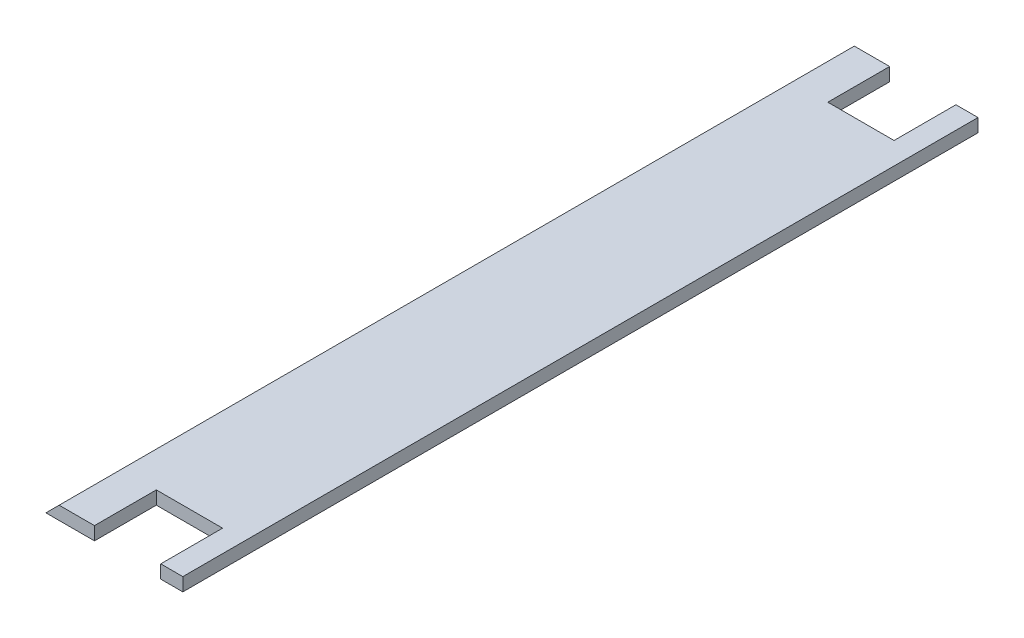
ISO-10303-21;
HEADER;
FILE_DESCRIPTION(('STEP AP214'),'2;1');
FILE_NAME('part.step','',(''),(''),'','','');
FILE_SCHEMA(('AUTOMOTIVE_DESIGN { 1 0 10303 214 1 1 1 1 }'));
ENDSEC;
DATA;
#1=APPLICATION_CONTEXT('core data for automotive mechanical design processes');
#2=APPLICATION_PROTOCOL_DEFINITION('international standard','automotive_design',2000,#1);
#3=PRODUCT_CONTEXT('',#1,'mechanical');
#4=PRODUCT('Part','Part','',(#3));
#5=PRODUCT_RELATED_PRODUCT_CATEGORY('part','',(#4));
#6=PRODUCT_DEFINITION_FORMATION('','',#4);
#7=PRODUCT_DEFINITION_CONTEXT('part definition',#1,'design');
#8=PRODUCT_DEFINITION('design','',#6,#7);
#9=PRODUCT_DEFINITION_SHAPE('','',#8);
#10=(LENGTH_UNIT() NAMED_UNIT(*) SI_UNIT(.MILLI.,.METRE.));
#11=(NAMED_UNIT(*) PLANE_ANGLE_UNIT() SI_UNIT($,.RADIAN.));
#12=(NAMED_UNIT(*) SI_UNIT($,.STERADIAN.) SOLID_ANGLE_UNIT());
#13=UNCERTAINTY_MEASURE_WITH_UNIT(LENGTH_MEASURE(1.E-05),#10,'distance_accuracy_value','');
#14=(GEOMETRIC_REPRESENTATION_CONTEXT(3) GLOBAL_UNCERTAINTY_ASSIGNED_CONTEXT((#13)) GLOBAL_UNIT_ASSIGNED_CONTEXT((#10,
#11,#12)) REPRESENTATION_CONTEXT('',''));
#15=CARTESIAN_POINT('',(0.,0.,0.));
#16=DIRECTION('',(0.,0.,1.));
#17=DIRECTION('',(1.,0.,0.));
#18=AXIS2_PLACEMENT_3D('',#15,#16,#17);
#19=CARTESIAN_POINT('',(0.,1.5,45.));
#20=DIRECTION('',(0.,0.,-1.));
#21=DIRECTION('',(-1.,0.,0.));
#22=AXIS2_PLACEMENT_3D('',#19,#20,#21);
#23=PLANE('',#22);
#24=DIRECTION('',(0.707106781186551,0.707106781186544,0.));
#25=VECTOR('',#24,1.);
#26=CARTESIAN_POINT('',(0.,0.,45.));
#27=LINE('',#26,#25);
#28=CARTESIAN_POINT('',(1.5,1.5,45.));
#29=VERTEX_POINT('',#28);
#30=CARTESIAN_POINT('',(0.0170710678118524,0.0170710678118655,45.));
#31=VERTEX_POINT('',#30);
#32=EDGE_CURVE('E167',#29,#31,#27,.F.);
#33=ORIENTED_EDGE('',*,*,#32,.T.);
#34=CARTESIAN_POINT('',(0.0241421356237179,0.01,45.));
#35=DIRECTION('',(0.,0.,-1.));
#36=DIRECTION('',(-1.,0.,0.));
#37=AXIS2_PLACEMENT_3D('',#34,#35,#36);
#38=CIRCLE('',#37,0.01);
#39=CARTESIAN_POINT('',(0.0241421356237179,0.,45.));
#40=VERTEX_POINT('',#39);
#41=EDGE_CURVE('E11',#31,#40,#38,.F.);
#42=ORIENTED_EDGE('',*,*,#41,.T.);
#43=DIRECTION('',(1.,0.,0.));
#44=VECTOR('',#43,1.);
#45=CARTESIAN_POINT('',(0.,0.,45.));
#46=LINE('',#45,#44);
#47=CARTESIAN_POINT('',(5.5,0.,45.));
#48=VERTEX_POINT('',#47);
#49=EDGE_CURVE('E143',#40,#48,#46,.T.);
#50=ORIENTED_EDGE('',*,*,#49,.T.);
#51=DIRECTION('',(0.,1.,0.));
#52=VECTOR('',#51,1.);
#53=CARTESIAN_POINT('',(5.5,0.,45.));
#54=LINE('',#53,#52);
#55=CARTESIAN_POINT('',(5.5,1.5,45.));
#56=VERTEX_POINT('',#55);
#57=EDGE_CURVE('E130',#48,#56,#54,.T.);
#58=ORIENTED_EDGE('',*,*,#57,.T.);
#59=DIRECTION('',(-1.,0.,0.));
#60=VECTOR('',#59,1.);
#61=CARTESIAN_POINT('',(0.,1.5,45.));
#62=LINE('',#61,#60);
#63=EDGE_CURVE('E141',#56,#29,#62,.T.);
#64=ORIENTED_EDGE('',*,*,#63,.T.);
#65=EDGE_LOOP('',(#33,#42,#50,#58,#64));
#66=FACE_BOUND('',#65,.T.);
#67=ADVANCED_FACE('F32',(#66),#23,.F.);
#68=CARTESIAN_POINT('',(0.,1.5,-45.));
#69=DIRECTION('',(0.,0.,-1.));
#70=DIRECTION('',(-1.,0.,0.));
#71=AXIS2_PLACEMENT_3D('',#68,#69,#70);
#72=PLANE('',#71);
#73=DIRECTION('',(1.,0.,0.));
#74=VECTOR('',#73,1.);
#75=CARTESIAN_POINT('',(0.,0.,-45.));
#76=LINE('',#75,#74);
#77=CARTESIAN_POINT('',(0.0241421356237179,0.,-45.));
#78=VERTEX_POINT('',#77);
#79=CARTESIAN_POINT('',(5.5,0.,-45.));
#80=VERTEX_POINT('',#79);
#81=EDGE_CURVE('E298',#78,#80,#76,.T.);
#82=ORIENTED_EDGE('',*,*,#81,.F.);
#83=CARTESIAN_POINT('',(0.0241421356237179,0.01,-45.));
#84=DIRECTION('',(0.,0.,-1.));
#85=DIRECTION('',(-1.,0.,0.));
#86=AXIS2_PLACEMENT_3D('',#83,#84,#85);
#87=CIRCLE('',#86,0.01);
#88=CARTESIAN_POINT('',(0.0170710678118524,0.0170710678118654,-45.));
#89=VERTEX_POINT('',#88);
#90=EDGE_CURVE('E54',#78,#89,#87,.T.);
#91=ORIENTED_EDGE('',*,*,#90,.T.);
#92=DIRECTION('',(-0.707106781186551,-0.707106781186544,0.));
#93=VECTOR('',#92,1.);
#94=CARTESIAN_POINT('',(0.749999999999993,0.75,-45.));
#95=LINE('',#94,#93);
#96=CARTESIAN_POINT('',(1.5,1.5,-45.));
#97=VERTEX_POINT('',#96);
#98=EDGE_CURVE('E164',#89,#97,#95,.F.);
#99=ORIENTED_EDGE('',*,*,#98,.T.);
#100=DIRECTION('',(-1.,0.,0.));
#101=VECTOR('',#100,1.);
#102=CARTESIAN_POINT('',(0.,1.5,-45.));
#103=LINE('',#102,#101);
#104=CARTESIAN_POINT('',(5.5,1.5,-45.));
#105=VERTEX_POINT('',#104);
#106=EDGE_CURVE('E295',#105,#97,#103,.T.);
#107=ORIENTED_EDGE('',*,*,#106,.F.);
#108=DIRECTION('',(0.,1.,0.));
#109=VECTOR('',#108,1.);
#110=CARTESIAN_POINT('',(5.5,0.,-45.));
#111=LINE('',#110,#109);
#112=EDGE_CURVE('E309',#80,#105,#111,.T.);
#113=ORIENTED_EDGE('',*,*,#112,.F.);
#114=EDGE_LOOP('',(#82,#91,#99,#107,#113));
#115=FACE_BOUND('',#114,.T.);
#116=ADVANCED_FACE('F225',(#115),#72,.T.);
#117=CARTESIAN_POINT('',(0.,0.,45.));
#118=DIRECTION('',(0.,1.,0.));
#119=DIRECTION('',(0.,0.,1.));
#120=AXIS2_PLACEMENT_3D('',#117,#118,#119);
#121=PLANE('',#120);
#122=ORIENTED_EDGE('',*,*,#49,.F.);
#123=DIRECTION('',(0.,0.,1.));
#124=VECTOR('',#123,1.);
#125=CARTESIAN_POINT('',(0.0241421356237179,0.,-45.));
#126=LINE('',#125,#124);
#127=EDGE_CURVE('E169',#40,#78,#126,.F.);
#128=ORIENTED_EDGE('',*,*,#127,.T.);
#129=ORIENTED_EDGE('',*,*,#81,.T.);
#130=DIRECTION('',(0.,0.,1.));
#131=VECTOR('',#130,1.);
#132=CARTESIAN_POINT('',(5.5,0.,-45.));
#133=LINE('',#132,#131);
#134=CARTESIAN_POINT('',(5.5,0.,-38.));
#135=VERTEX_POINT('',#134);
#136=EDGE_CURVE('E316',#80,#135,#133,.T.);
#137=ORIENTED_EDGE('',*,*,#136,.T.);
#138=DIRECTION('',(1.,0.,0.));
#139=VECTOR('',#138,1.);
#140=CARTESIAN_POINT('',(5.5,0.,-38.));
#141=LINE('',#140,#139);
#142=CARTESIAN_POINT('',(13.,0.,-38.));
#143=VERTEX_POINT('',#142);
#144=EDGE_CURVE('E313',#135,#143,#141,.T.);
#145=ORIENTED_EDGE('',*,*,#144,.T.);
#146=DIRECTION('',(0.,0.,-1.));
#147=VECTOR('',#146,1.);
#148=CARTESIAN_POINT('',(13.,0.,-45.));
#149=LINE('',#148,#147);
#150=CARTESIAN_POINT('',(13.,0.,-45.));
#151=VERTEX_POINT('',#150);
#152=EDGE_CURVE('E304',#143,#151,#149,.T.);
#153=ORIENTED_EDGE('',*,*,#152,.T.);
#154=CARTESIAN_POINT('',(15.5,0.,-45.));
#155=VERTEX_POINT('',#154);
#156=EDGE_CURVE('E300',#151,#155,#76,.T.);
#157=ORIENTED_EDGE('',*,*,#156,.T.);
#158=DIRECTION('',(0.,0.,-1.));
#159=VECTOR('',#158,1.);
#160=CARTESIAN_POINT('',(15.5,0.,45.));
#161=LINE('',#160,#159);
#162=CARTESIAN_POINT('',(15.5,0.,45.));
#163=VERTEX_POINT('',#162);
#164=EDGE_CURVE('E161',#163,#155,#161,.T.);
#165=ORIENTED_EDGE('',*,*,#164,.F.);
#166=CARTESIAN_POINT('',(13.,0.,45.));
#167=VERTEX_POINT('',#166);
#168=EDGE_CURVE('E290',#167,#163,#46,.T.);
#169=ORIENTED_EDGE('',*,*,#168,.F.);
#170=DIRECTION('',(0.,0.,-1.));
#171=VECTOR('',#170,1.);
#172=CARTESIAN_POINT('',(13.,0.,45.));
#173=LINE('',#172,#171);
#174=CARTESIAN_POINT('',(13.,0.,38.));
#175=VERTEX_POINT('',#174);
#176=EDGE_CURVE('E327',#167,#175,#173,.T.);
#177=ORIENTED_EDGE('',*,*,#176,.T.);
#178=DIRECTION('',(-1.,0.,0.));
#179=VECTOR('',#178,1.);
#180=CARTESIAN_POINT('',(5.5,0.,38.));
#181=LINE('',#180,#179);
#182=CARTESIAN_POINT('',(5.5,0.,38.));
#183=VERTEX_POINT('',#182);
#184=EDGE_CURVE('E145',#175,#183,#181,.T.);
#185=ORIENTED_EDGE('',*,*,#184,.T.);
#186=DIRECTION('',(0.,0.,1.));
#187=VECTOR('',#186,1.);
#188=CARTESIAN_POINT('',(5.5,0.,45.));
#189=LINE('',#188,#187);
#190=EDGE_CURVE('E289',#183,#48,#189,.T.);
#191=ORIENTED_EDGE('',*,*,#190,.T.);
#192=EDGE_LOOP('',(#122,#128,#129,#137,#145,#153,#157,#165,#169,#177,#185,#191));
#193=FACE_BOUND('',#192,.T.);
#194=ADVANCED_FACE('F34',(#193),#121,.F.);
#195=CARTESIAN_POINT('',(15.5,0.,45.));
#196=DIRECTION('',(-1.,0.,0.));
#197=DIRECTION('',(0.,0.,1.));
#198=AXIS2_PLACEMENT_3D('',#195,#196,#197);
#199=PLANE('',#198);
#200=DIRECTION('',(0.,1.,0.));
#201=VECTOR('',#200,1.);
#202=CARTESIAN_POINT('',(15.5,0.,-45.));
#203=LINE('',#202,#201);
#204=CARTESIAN_POINT('',(15.5,1.5,-45.));
#205=VERTEX_POINT('',#204);
#206=EDGE_CURVE('E296',#155,#205,#203,.T.);
#207=ORIENTED_EDGE('',*,*,#206,.T.);
#208=DIRECTION('',(0.,0.,-1.));
#209=VECTOR('',#208,1.);
#210=CARTESIAN_POINT('',(15.5,1.5,45.));
#211=LINE('',#210,#209);
#212=CARTESIAN_POINT('',(15.5,1.5,45.));
#213=VERTEX_POINT('',#212);
#214=EDGE_CURVE('E155',#213,#205,#211,.T.);
#215=ORIENTED_EDGE('',*,*,#214,.F.);
#216=DIRECTION('',(0.,1.,0.));
#217=VECTOR('',#216,1.);
#218=CARTESIAN_POINT('',(15.5,0.,45.));
#219=LINE('',#218,#217);
#220=EDGE_CURVE('E152',#163,#213,#219,.T.);
#221=ORIENTED_EDGE('',*,*,#220,.F.);
#222=ORIENTED_EDGE('',*,*,#164,.T.);
#223=EDGE_LOOP('',(#207,#215,#221,#222));
#224=FACE_BOUND('',#223,.T.);
#225=ADVANCED_FACE('F202',(#224),#199,.F.);
#226=CARTESIAN_POINT('',(0.,1.5,45.));
#227=DIRECTION('',(0.,-1.,0.));
#228=DIRECTION('',(0.,0.,-1.));
#229=AXIS2_PLACEMENT_3D('',#226,#227,#228);
#230=PLANE('',#229);
#231=ORIENTED_EDGE('',*,*,#106,.T.);
#232=DIRECTION('',(0.,0.,1.));
#233=VECTOR('',#232,1.);
#234=CARTESIAN_POINT('',(1.5,1.5,45.));
#235=LINE('',#234,#233);
#236=EDGE_CURVE('E150',#97,#29,#235,.T.);
#237=ORIENTED_EDGE('',*,*,#236,.T.);
#238=ORIENTED_EDGE('',*,*,#63,.F.);
#239=DIRECTION('',(0.,0.,1.));
#240=VECTOR('',#239,1.);
#241=CARTESIAN_POINT('',(5.5,1.5,45.));
#242=LINE('',#241,#240);
#243=CARTESIAN_POINT('',(5.5,1.5,38.));
#244=VERTEX_POINT('',#243);
#245=EDGE_CURVE('E126',#244,#56,#242,.T.);
#246=ORIENTED_EDGE('',*,*,#245,.F.);
#247=DIRECTION('',(-1.,0.,0.));
#248=VECTOR('',#247,1.);
#249=CARTESIAN_POINT('',(5.5,1.5,38.));
#250=LINE('',#249,#248);
#251=CARTESIAN_POINT('',(13.,1.5,38.));
#252=VERTEX_POINT('',#251);
#253=EDGE_CURVE('E331',#252,#244,#250,.T.);
#254=ORIENTED_EDGE('',*,*,#253,.F.);
#255=DIRECTION('',(0.,0.,-1.));
#256=VECTOR('',#255,1.);
#257=CARTESIAN_POINT('',(13.,1.5,45.));
#258=LINE('',#257,#256);
#259=CARTESIAN_POINT('',(13.,1.5,45.));
#260=VERTEX_POINT('',#259);
#261=EDGE_CURVE('E137',#260,#252,#258,.T.);
#262=ORIENTED_EDGE('',*,*,#261,.F.);
#263=EDGE_CURVE('E151',#213,#260,#62,.T.);
#264=ORIENTED_EDGE('',*,*,#263,.F.);
#265=ORIENTED_EDGE('',*,*,#214,.T.);
#266=CARTESIAN_POINT('',(13.,1.5,-45.));
#267=VERTEX_POINT('',#266);
#268=EDGE_CURVE('E291',#205,#267,#103,.T.);
#269=ORIENTED_EDGE('',*,*,#268,.T.);
#270=DIRECTION('',(0.,0.,-1.));
#271=VECTOR('',#270,1.);
#272=CARTESIAN_POINT('',(13.,1.5,-45.));
#273=LINE('',#272,#271);
#274=CARTESIAN_POINT('',(13.,1.5,-38.));
#275=VERTEX_POINT('',#274);
#276=EDGE_CURVE('E179',#275,#267,#273,.T.);
#277=ORIENTED_EDGE('',*,*,#276,.F.);
#278=DIRECTION('',(1.,0.,0.));
#279=VECTOR('',#278,1.);
#280=CARTESIAN_POINT('',(5.5,1.5,-38.));
#281=LINE('',#280,#279);
#282=CARTESIAN_POINT('',(5.5,1.5,-38.));
#283=VERTEX_POINT('',#282);
#284=EDGE_CURVE('E175',#283,#275,#281,.T.);
#285=ORIENTED_EDGE('',*,*,#284,.F.);
#286=DIRECTION('',(0.,0.,1.));
#287=VECTOR('',#286,1.);
#288=CARTESIAN_POINT('',(5.5,1.5,-45.));
#289=LINE('',#288,#287);
#290=EDGE_CURVE('E180',#105,#283,#289,.T.);
#291=ORIENTED_EDGE('',*,*,#290,.F.);
#292=EDGE_LOOP('',(#231,#237,#238,#246,#254,#262,#264,#265,#269,#277,#285,#291));
#293=FACE_BOUND('',#292,.T.);
#294=ADVANCED_FACE('F148',(#293),#230,.F.);
#295=ORIENTED_EDGE('',*,*,#263,.T.);
#296=DIRECTION('',(0.,1.,0.));
#297=VECTOR('',#296,1.);
#298=CARTESIAN_POINT('',(13.,0.,45.));
#299=LINE('',#298,#297);
#300=EDGE_CURVE('E144',#167,#260,#299,.T.);
#301=ORIENTED_EDGE('',*,*,#300,.F.);
#302=ORIENTED_EDGE('',*,*,#168,.T.);
#303=ORIENTED_EDGE('',*,*,#220,.T.);
#304=EDGE_LOOP('',(#295,#301,#302,#303));
#305=FACE_BOUND('',#304,.T.);
#306=ADVANCED_FACE('F201',(#305),#23,.F.);
#307=DIRECTION('',(0.,1.,0.));
#308=VECTOR('',#307,1.);
#309=CARTESIAN_POINT('',(13.,0.,-45.));
#310=LINE('',#309,#308);
#311=EDGE_CURVE('E306',#151,#267,#310,.T.);
#312=ORIENTED_EDGE('',*,*,#311,.T.);
#313=ORIENTED_EDGE('',*,*,#268,.F.);
#314=ORIENTED_EDGE('',*,*,#206,.F.);
#315=ORIENTED_EDGE('',*,*,#156,.F.);
#316=EDGE_LOOP('',(#312,#313,#314,#315));
#317=FACE_BOUND('',#316,.T.);
#318=ADVANCED_FACE('F234',(#317),#72,.T.);
#319=CARTESIAN_POINT('',(5.5,0.,-45.));
#320=DIRECTION('',(-1.,0.,0.));
#321=DIRECTION('',(0.,0.,1.));
#322=AXIS2_PLACEMENT_3D('',#319,#320,#321);
#323=PLANE('',#322);
#324=ORIENTED_EDGE('',*,*,#290,.T.);
#325=DIRECTION('',(0.,1.,0.));
#326=VECTOR('',#325,1.);
#327=CARTESIAN_POINT('',(5.5,0.,-38.));
#328=LINE('',#327,#326);
#329=EDGE_CURVE('E301',#135,#283,#328,.T.);
#330=ORIENTED_EDGE('',*,*,#329,.F.);
#331=ORIENTED_EDGE('',*,*,#136,.F.);
#332=ORIENTED_EDGE('',*,*,#112,.T.);
#333=EDGE_LOOP('',(#324,#330,#331,#332));
#334=FACE_BOUND('',#333,.T.);
#335=ADVANCED_FACE('F213',(#334),#323,.F.);
#336=CARTESIAN_POINT('',(13.,0.,-45.));
#337=DIRECTION('',(1.,0.,0.));
#338=DIRECTION('',(0.,0.,-1.));
#339=AXIS2_PLACEMENT_3D('',#336,#337,#338);
#340=PLANE('',#339);
#341=ORIENTED_EDGE('',*,*,#276,.T.);
#342=ORIENTED_EDGE('',*,*,#311,.F.);
#343=ORIENTED_EDGE('',*,*,#152,.F.);
#344=DIRECTION('',(0.,1.,0.));
#345=VECTOR('',#344,1.);
#346=CARTESIAN_POINT('',(13.,0.,-38.));
#347=LINE('',#346,#345);
#348=EDGE_CURVE('E303',#143,#275,#347,.T.);
#349=ORIENTED_EDGE('',*,*,#348,.T.);
#350=EDGE_LOOP('',(#341,#342,#343,#349));
#351=FACE_BOUND('',#350,.T.);
#352=ADVANCED_FACE('F187',(#351),#340,.F.);
#353=CARTESIAN_POINT('',(5.5,0.,-38.));
#354=DIRECTION('',(0.,0.,1.));
#355=DIRECTION('',(1.,0.,0.));
#356=AXIS2_PLACEMENT_3D('',#353,#354,#355);
#357=PLANE('',#356);
#358=ORIENTED_EDGE('',*,*,#284,.T.);
#359=ORIENTED_EDGE('',*,*,#348,.F.);
#360=ORIENTED_EDGE('',*,*,#144,.F.);
#361=ORIENTED_EDGE('',*,*,#329,.T.);
#362=EDGE_LOOP('',(#358,#359,#360,#361));
#363=FACE_BOUND('',#362,.T.);
#364=ADVANCED_FACE('F182',(#363),#357,.F.);
#365=CARTESIAN_POINT('',(5.5,0.,45.));
#366=DIRECTION('',(-1.,0.,0.));
#367=DIRECTION('',(0.,0.,1.));
#368=AXIS2_PLACEMENT_3D('',#365,#366,#367);
#369=PLANE('',#368);
#370=ORIENTED_EDGE('',*,*,#245,.T.);
#371=ORIENTED_EDGE('',*,*,#57,.F.);
#372=ORIENTED_EDGE('',*,*,#190,.F.);
#373=DIRECTION('',(0.,1.,0.));
#374=VECTOR('',#373,1.);
#375=CARTESIAN_POINT('',(5.5,0.,38.));
#376=LINE('',#375,#374);
#377=EDGE_CURVE('E132',#183,#244,#376,.T.);
#378=ORIENTED_EDGE('',*,*,#377,.T.);
#379=EDGE_LOOP('',(#370,#371,#372,#378));
#380=FACE_BOUND('',#379,.T.);
#381=ADVANCED_FACE('F128',(#380),#369,.F.);
#382=CARTESIAN_POINT('',(5.5,0.,38.));
#383=DIRECTION('',(0.,0.,-1.));
#384=DIRECTION('',(-1.,0.,0.));
#385=AXIS2_PLACEMENT_3D('',#382,#383,#384);
#386=PLANE('',#385);
#387=ORIENTED_EDGE('',*,*,#253,.T.);
#388=ORIENTED_EDGE('',*,*,#377,.F.);
#389=ORIENTED_EDGE('',*,*,#184,.F.);
#390=DIRECTION('',(0.,1.,0.));
#391=VECTOR('',#390,1.);
#392=CARTESIAN_POINT('',(13.,0.,38.));
#393=LINE('',#392,#391);
#394=EDGE_CURVE('E323',#175,#252,#393,.T.);
#395=ORIENTED_EDGE('',*,*,#394,.T.);
#396=EDGE_LOOP('',(#387,#388,#389,#395));
#397=FACE_BOUND('',#396,.T.);
#398=ADVANCED_FACE('F270',(#397),#386,.F.);
#399=CARTESIAN_POINT('',(13.,0.,45.));
#400=DIRECTION('',(1.,0.,0.));
#401=DIRECTION('',(0.,0.,-1.));
#402=AXIS2_PLACEMENT_3D('',#399,#400,#401);
#403=PLANE('',#402);
#404=ORIENTED_EDGE('',*,*,#261,.T.);
#405=ORIENTED_EDGE('',*,*,#394,.F.);
#406=ORIENTED_EDGE('',*,*,#176,.F.);
#407=ORIENTED_EDGE('',*,*,#300,.T.);
#408=EDGE_LOOP('',(#404,#405,#406,#407));
#409=FACE_BOUND('',#408,.T.);
#410=ADVANCED_FACE('F271',(#409),#403,.F.);
#411=CARTESIAN_POINT('',(0.,0.,45.));
#412=DIRECTION('',(0.707106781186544,-0.707106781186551,0.));
#413=DIRECTION('',(0.707106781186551,0.707106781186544,0.));
#414=AXIS2_PLACEMENT_3D('',#411,#412,#413);
#415=PLANE('',#414);
#416=ORIENTED_EDGE('',*,*,#98,.F.);
#417=DIRECTION('',(0.,0.,-1.));
#418=VECTOR('',#417,1.);
#419=CARTESIAN_POINT('',(0.0170710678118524,0.0170710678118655,45.));
#420=LINE('',#419,#418);
#421=EDGE_CURVE('E40',#89,#31,#420,.F.);
#422=ORIENTED_EDGE('',*,*,#421,.T.);
#423=ORIENTED_EDGE('',*,*,#32,.F.);
#424=ORIENTED_EDGE('',*,*,#236,.F.);
#425=EDGE_LOOP('',(#416,#422,#423,#424));
#426=FACE_BOUND('',#425,.T.);
#427=ADVANCED_FACE('F274',(#426),#415,.F.);
#428=CARTESIAN_POINT('',(0.0241421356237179,0.01,45.));
#429=DIRECTION('',(0.,0.,-1.));
#430=DIRECTION('',(-1.,0.,0.));
#431=AXIS2_PLACEMENT_3D('',#428,#429,#430);
#432=CYLINDRICAL_SURFACE('',#431,0.01);
#433=ORIENTED_EDGE('',*,*,#41,.F.);
#434=ORIENTED_EDGE('',*,*,#421,.F.);
#435=ORIENTED_EDGE('',*,*,#90,.F.);
#436=ORIENTED_EDGE('',*,*,#127,.F.);
#437=EDGE_LOOP('',(#433,#434,#435,#436));
#438=FACE_BOUND('',#437,.T.);
#439=ADVANCED_FACE('F281',(#438),#432,.T.);
#440=CLOSED_SHELL('',(#67,#116,#194,#225,#294,#306,#318,#335,#352,#364,#381,#398,#410,#427,#439));
#441=MANIFOLD_SOLID_BREP('B2',#440);
#442=ADVANCED_BREP_SHAPE_REPRESENTATION('',(#18,#441),#14);
#443=SHAPE_DEFINITION_REPRESENTATION(#9,#442);
ENDSEC;
END-ISO-10303-21;
